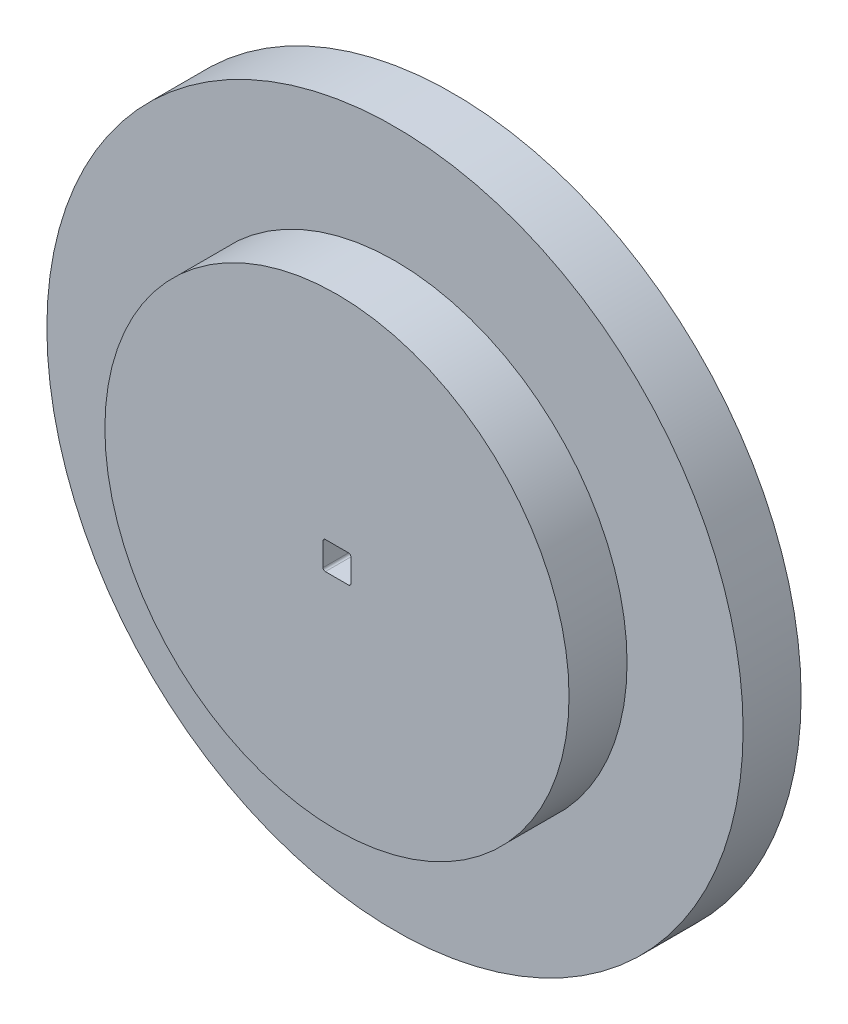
ISO-10303-21;
HEADER;
FILE_DESCRIPTION(('STEP AP214'),'2;1');
FILE_NAME('part.step','',(''),(''),'','','');
FILE_SCHEMA(('AUTOMOTIVE_DESIGN { 1 0 10303 214 1 1 1 1 }'));
ENDSEC;
DATA;
#1=APPLICATION_CONTEXT('core data for automotive mechanical design processes');
#2=APPLICATION_PROTOCOL_DEFINITION('international standard','automotive_design',2000,#1);
#3=PRODUCT_CONTEXT('',#1,'mechanical');
#4=PRODUCT('Part','Part','',(#3));
#5=PRODUCT_RELATED_PRODUCT_CATEGORY('part','',(#4));
#6=PRODUCT_DEFINITION_FORMATION('','',#4);
#7=PRODUCT_DEFINITION_CONTEXT('part definition',#1,'design');
#8=PRODUCT_DEFINITION('design','',#6,#7);
#9=PRODUCT_DEFINITION_SHAPE('','',#8);
#10=(LENGTH_UNIT() NAMED_UNIT(*) SI_UNIT(.MILLI.,.METRE.));
#11=(NAMED_UNIT(*) PLANE_ANGLE_UNIT() SI_UNIT($,.RADIAN.));
#12=(NAMED_UNIT(*) SI_UNIT($,.STERADIAN.) SOLID_ANGLE_UNIT());
#13=UNCERTAINTY_MEASURE_WITH_UNIT(LENGTH_MEASURE(1.E-05),#10,'distance_accuracy_value','');
#14=(GEOMETRIC_REPRESENTATION_CONTEXT(3) GLOBAL_UNCERTAINTY_ASSIGNED_CONTEXT((#13)) GLOBAL_UNIT_ASSIGNED_CONTEXT((#10,
#11,#12)) REPRESENTATION_CONTEXT('',''));
#15=CARTESIAN_POINT('',(0.,0.,0.));
#16=DIRECTION('',(0.,0.,1.));
#17=DIRECTION('',(1.,0.,0.));
#18=AXIS2_PLACEMENT_3D('',#15,#16,#17);
#19=CARTESIAN_POINT('',(0.,0.,6.35));
#20=DIRECTION('',(0.,0.,-1.));
#21=DIRECTION('',(-1.,0.,0.));
#22=AXIS2_PLACEMENT_3D('',#19,#20,#21);
#23=CYLINDRICAL_SURFACE('',#22,38.1);
#24=CARTESIAN_POINT('',(0.,0.,6.35));
#25=DIRECTION('',(0.,0.,1.));
#26=DIRECTION('',(1.,0.,0.));
#27=AXIS2_PLACEMENT_3D('',#24,#25,#26);
#28=CIRCLE('',#27,38.1);
#29=CARTESIAN_POINT('',(38.1,0.,6.35));
#30=VERTEX_POINT('',#29);
#31=EDGE_CURVE('E142',#30,#30,#28,.T.);
#32=ORIENTED_EDGE('',*,*,#31,.F.);
#33=EDGE_LOOP('',(#32));
#34=FACE_BOUND('',#33,.T.);
#35=CARTESIAN_POINT('',(0.,0.,0.));
#36=DIRECTION('',(0.,0.,1.));
#37=DIRECTION('',(1.,0.,0.));
#38=AXIS2_PLACEMENT_3D('',#35,#36,#37);
#39=CIRCLE('',#38,38.1);
#40=CARTESIAN_POINT('',(38.1,0.,0.));
#41=VERTEX_POINT('',#40);
#42=EDGE_CURVE('E137',#41,#41,#39,.T.);
#43=ORIENTED_EDGE('',*,*,#42,.T.);
#44=EDGE_LOOP('',(#43));
#45=FACE_BOUND('',#44,.T.);
#46=ADVANCED_FACE('F33',(#34,#45),#23,.T.);
#47=CARTESIAN_POINT('',(0.,0.,6.35));
#48=DIRECTION('',(0.,0.,1.));
#49=DIRECTION('',(1.,0.,0.));
#50=AXIS2_PLACEMENT_3D('',#47,#48,#49);
#51=PLANE('',#50);
#52=CARTESIAN_POINT('',(0.,0.,6.35));
#53=DIRECTION('',(0.,0.,1.));
#54=DIRECTION('',(1.,0.,0.));
#55=AXIS2_PLACEMENT_3D('',#52,#53,#54);
#56=CIRCLE('',#55,25.4);
#57=CARTESIAN_POINT('',(25.4,0.,6.35));
#58=VERTEX_POINT('',#57);
#59=EDGE_CURVE('E138',#58,#58,#56,.T.);
#60=ORIENTED_EDGE('',*,*,#59,.F.);
#61=EDGE_LOOP('',(#60));
#62=FACE_BOUND('',#61,.T.);
#63=ORIENTED_EDGE('',*,*,#31,.T.);
#64=EDGE_LOOP('',(#63));
#65=FACE_BOUND('',#64,.T.);
#66=ADVANCED_FACE('F203',(#62,#65),#51,.T.);
#67=CARTESIAN_POINT('',(0.,0.,0.));
#68=DIRECTION('',(0.,0.,1.));
#69=DIRECTION('',(1.,0.,0.));
#70=AXIS2_PLACEMENT_3D('',#67,#68,#69);
#71=PLANE('',#70);
#72=DIRECTION('',(1.,0.,0.));
#73=VECTOR('',#72,1.);
#74=CARTESIAN_POINT('',(1.524,1.524,0.));
#75=LINE('',#74,#73);
#76=CARTESIAN_POINT('',(-1.27,1.524,0.));
#77=VERTEX_POINT('',#76);
#78=CARTESIAN_POINT('',(1.27,1.524,0.));
#79=VERTEX_POINT('',#78);
#80=EDGE_CURVE('E114',#77,#79,#75,.T.);
#81=ORIENTED_EDGE('',*,*,#80,.F.);
#82=CARTESIAN_POINT('',(-1.27,1.27,0.));
#83=DIRECTION('',(0.,0.,1.));
#84=DIRECTION('',(1.,0.,0.));
#85=AXIS2_PLACEMENT_3D('',#82,#83,#84);
#86=CIRCLE('',#85,0.254);
#87=CARTESIAN_POINT('',(-1.524,1.27,0.));
#88=VERTEX_POINT('',#87);
#89=EDGE_CURVE('E98',#77,#88,#86,.T.);
#90=ORIENTED_EDGE('',*,*,#89,.T.);
#91=DIRECTION('',(0.,1.,0.));
#92=VECTOR('',#91,1.);
#93=CARTESIAN_POINT('',(-1.524,1.524,0.));
#94=LINE('',#93,#92);
#95=CARTESIAN_POINT('',(-1.524,-1.27,0.));
#96=VERTEX_POINT('',#95);
#97=EDGE_CURVE('E124',#96,#88,#94,.T.);
#98=ORIENTED_EDGE('',*,*,#97,.F.);
#99=CARTESIAN_POINT('',(-1.27,-1.27,0.));
#100=DIRECTION('',(0.,0.,1.));
#101=DIRECTION('',(1.,0.,0.));
#102=AXIS2_PLACEMENT_3D('',#99,#100,#101);
#103=CIRCLE('',#102,0.254);
#104=CARTESIAN_POINT('',(-1.27,-1.524,0.));
#105=VERTEX_POINT('',#104);
#106=EDGE_CURVE('E161',#96,#105,#103,.T.);
#107=ORIENTED_EDGE('',*,*,#106,.T.);
#108=DIRECTION('',(-1.,0.,0.));
#109=VECTOR('',#108,1.);
#110=CARTESIAN_POINT('',(1.524,-1.524,0.));
#111=LINE('',#110,#109);
#112=CARTESIAN_POINT('',(1.27,-1.524,0.));
#113=VERTEX_POINT('',#112);
#114=EDGE_CURVE('E126',#113,#105,#111,.T.);
#115=ORIENTED_EDGE('',*,*,#114,.F.);
#116=CARTESIAN_POINT('',(1.27,-1.27,0.));
#117=DIRECTION('',(0.,0.,1.));
#118=DIRECTION('',(1.,0.,0.));
#119=AXIS2_PLACEMENT_3D('',#116,#117,#118);
#120=CIRCLE('',#119,0.254);
#121=CARTESIAN_POINT('',(1.524,-1.27,0.));
#122=VERTEX_POINT('',#121);
#123=EDGE_CURVE('E165',#113,#122,#120,.T.);
#124=ORIENTED_EDGE('',*,*,#123,.T.);
#125=DIRECTION('',(0.,-1.,0.));
#126=VECTOR('',#125,1.);
#127=CARTESIAN_POINT('',(1.524,1.524,0.));
#128=LINE('',#127,#126);
#129=CARTESIAN_POINT('',(1.524,1.27,0.));
#130=VERTEX_POINT('',#129);
#131=EDGE_CURVE('E123',#130,#122,#128,.T.);
#132=ORIENTED_EDGE('',*,*,#131,.F.);
#133=CARTESIAN_POINT('',(1.27,1.27,0.));
#134=DIRECTION('',(0.,0.,1.));
#135=DIRECTION('',(1.,0.,0.));
#136=AXIS2_PLACEMENT_3D('',#133,#134,#135);
#137=CIRCLE('',#136,0.254);
#138=EDGE_CURVE('E41',#130,#79,#137,.T.);
#139=ORIENTED_EDGE('',*,*,#138,.T.);
#140=EDGE_LOOP('',(#81,#90,#98,#107,#115,#124,#132,#139));
#141=FACE_BOUND('',#140,.T.);
#142=ORIENTED_EDGE('',*,*,#42,.F.);
#143=EDGE_LOOP('',(#142));
#144=FACE_BOUND('',#143,.T.);
#145=ADVANCED_FACE('F120',(#141,#144),#71,.F.);
#146=CARTESIAN_POINT('',(0.,0.,12.7));
#147=DIRECTION('',(0.,0.,-1.));
#148=DIRECTION('',(-1.,0.,0.));
#149=AXIS2_PLACEMENT_3D('',#146,#147,#148);
#150=CYLINDRICAL_SURFACE('',#149,25.4);
#151=CARTESIAN_POINT('',(0.,0.,12.7));
#152=DIRECTION('',(0.,0.,1.));
#153=DIRECTION('',(1.,0.,0.));
#154=AXIS2_PLACEMENT_3D('',#151,#152,#153);
#155=CIRCLE('',#154,25.4);
#156=CARTESIAN_POINT('',(25.4,0.,12.7));
#157=VERTEX_POINT('',#156);
#158=EDGE_CURVE('E134',#157,#157,#155,.T.);
#159=ORIENTED_EDGE('',*,*,#158,.F.);
#160=EDGE_LOOP('',(#159));
#161=FACE_BOUND('',#160,.T.);
#162=ORIENTED_EDGE('',*,*,#59,.T.);
#163=EDGE_LOOP('',(#162));
#164=FACE_BOUND('',#163,.T.);
#165=ADVANCED_FACE('F215',(#161,#164),#150,.T.);
#166=CARTESIAN_POINT('',(0.,0.,12.7));
#167=DIRECTION('',(0.,0.,1.));
#168=DIRECTION('',(1.,0.,0.));
#169=AXIS2_PLACEMENT_3D('',#166,#167,#168);
#170=PLANE('',#169);
#171=DIRECTION('',(-1.,0.,0.));
#172=VECTOR('',#171,1.);
#173=CARTESIAN_POINT('',(1.524,-1.524,12.7));
#174=LINE('',#173,#172);
#175=CARTESIAN_POINT('',(1.27,-1.524,12.7));
#176=VERTEX_POINT('',#175);
#177=CARTESIAN_POINT('',(-1.27,-1.524,12.7));
#178=VERTEX_POINT('',#177);
#179=EDGE_CURVE('E141',#176,#178,#174,.T.);
#180=ORIENTED_EDGE('',*,*,#179,.T.);
#181=CARTESIAN_POINT('',(-1.27,-1.27,12.7));
#182=DIRECTION('',(0.,0.,1.));
#183=DIRECTION('',(1.,0.,0.));
#184=AXIS2_PLACEMENT_3D('',#181,#182,#183);
#185=CIRCLE('',#184,0.254);
#186=CARTESIAN_POINT('',(-1.524,-1.27,12.7));
#187=VERTEX_POINT('',#186);
#188=EDGE_CURVE('E163',#178,#187,#185,.F.);
#189=ORIENTED_EDGE('',*,*,#188,.T.);
#190=DIRECTION('',(0.,1.,0.));
#191=VECTOR('',#190,1.);
#192=CARTESIAN_POINT('',(-1.524,1.524,12.7));
#193=LINE('',#192,#191);
#194=CARTESIAN_POINT('',(-1.524,1.27,12.7));
#195=VERTEX_POINT('',#194);
#196=EDGE_CURVE('E133',#187,#195,#193,.T.);
#197=ORIENTED_EDGE('',*,*,#196,.T.);
#198=CARTESIAN_POINT('',(-1.27,1.27,12.7));
#199=DIRECTION('',(0.,0.,1.));
#200=DIRECTION('',(1.,0.,0.));
#201=AXIS2_PLACEMENT_3D('',#198,#199,#200);
#202=CIRCLE('',#201,0.254);
#203=CARTESIAN_POINT('',(-1.27,1.524,12.7));
#204=VERTEX_POINT('',#203);
#205=EDGE_CURVE('E108',#195,#204,#202,.F.);
#206=ORIENTED_EDGE('',*,*,#205,.T.);
#207=DIRECTION('',(1.,0.,0.));
#208=VECTOR('',#207,1.);
#209=CARTESIAN_POINT('',(1.524,1.524,12.7));
#210=LINE('',#209,#208);
#211=CARTESIAN_POINT('',(1.27,1.524,12.7));
#212=VERTEX_POINT('',#211);
#213=EDGE_CURVE('E116',#204,#212,#210,.T.);
#214=ORIENTED_EDGE('',*,*,#213,.T.);
#215=CARTESIAN_POINT('',(1.27,1.27,12.7));
#216=DIRECTION('',(0.,0.,1.));
#217=DIRECTION('',(1.,0.,0.));
#218=AXIS2_PLACEMENT_3D('',#215,#216,#217);
#219=CIRCLE('',#218,0.254);
#220=CARTESIAN_POINT('',(1.524,1.27,12.7));
#221=VERTEX_POINT('',#220);
#222=EDGE_CURVE('E11',#212,#221,#219,.F.);
#223=ORIENTED_EDGE('',*,*,#222,.T.);
#224=DIRECTION('',(0.,-1.,0.));
#225=VECTOR('',#224,1.);
#226=CARTESIAN_POINT('',(1.524,1.524,12.7));
#227=LINE('',#226,#225);
#228=CARTESIAN_POINT('',(1.524,-1.27,12.7));
#229=VERTEX_POINT('',#228);
#230=EDGE_CURVE('E174',#221,#229,#227,.T.);
#231=ORIENTED_EDGE('',*,*,#230,.T.);
#232=CARTESIAN_POINT('',(1.27,-1.27,12.7));
#233=DIRECTION('',(0.,0.,1.));
#234=DIRECTION('',(1.,0.,0.));
#235=AXIS2_PLACEMENT_3D('',#232,#233,#234);
#236=CIRCLE('',#235,0.254);
#237=EDGE_CURVE('E167',#229,#176,#236,.F.);
#238=ORIENTED_EDGE('',*,*,#237,.T.);
#239=EDGE_LOOP('',(#180,#189,#197,#206,#214,#223,#231,#238));
#240=FACE_BOUND('',#239,.T.);
#241=ORIENTED_EDGE('',*,*,#158,.T.);
#242=EDGE_LOOP('',(#241));
#243=FACE_BOUND('',#242,.T.);
#244=ADVANCED_FACE('F171',(#240,#243),#170,.T.);
#245=CARTESIAN_POINT('',(-1.524,1.524,12.7));
#246=DIRECTION('',(-1.,0.,0.));
#247=DIRECTION('',(0.,-1.,0.));
#248=AXIS2_PLACEMENT_3D('',#245,#246,#247);
#249=PLANE('',#248);
#250=ORIENTED_EDGE('',*,*,#97,.T.);
#251=DIRECTION('',(0.,0.,-1.));
#252=VECTOR('',#251,1.);
#253=CARTESIAN_POINT('',(-1.524,1.27,12.7));
#254=LINE('',#253,#252);
#255=EDGE_CURVE('E103',#88,#195,#254,.F.);
#256=ORIENTED_EDGE('',*,*,#255,.T.);
#257=ORIENTED_EDGE('',*,*,#196,.F.);
#258=DIRECTION('',(0.,0.,-1.));
#259=VECTOR('',#258,1.);
#260=CARTESIAN_POINT('',(-1.524,-1.27,0.));
#261=LINE('',#260,#259);
#262=EDGE_CURVE('E117',#187,#96,#261,.T.);
#263=ORIENTED_EDGE('',*,*,#262,.T.);
#264=EDGE_LOOP('',(#250,#256,#257,#263));
#265=FACE_BOUND('',#264,.T.);
#266=ADVANCED_FACE('F192',(#265),#249,.F.);
#267=CARTESIAN_POINT('',(1.524,-1.524,12.7));
#268=DIRECTION('',(0.,-1.,0.));
#269=DIRECTION('',(0.,0.,-1.));
#270=AXIS2_PLACEMENT_3D('',#267,#268,#269);
#271=PLANE('',#270);
#272=ORIENTED_EDGE('',*,*,#114,.T.);
#273=DIRECTION('',(0.,0.,-1.));
#274=VECTOR('',#273,1.);
#275=CARTESIAN_POINT('',(-1.27,-1.524,12.7));
#276=LINE('',#275,#274);
#277=EDGE_CURVE('E154',#105,#178,#276,.F.);
#278=ORIENTED_EDGE('',*,*,#277,.T.);
#279=ORIENTED_EDGE('',*,*,#179,.F.);
#280=DIRECTION('',(0.,0.,-1.));
#281=VECTOR('',#280,1.);
#282=CARTESIAN_POINT('',(1.27,-1.524,0.));
#283=LINE('',#282,#281);
#284=EDGE_CURVE('E151',#176,#113,#283,.T.);
#285=ORIENTED_EDGE('',*,*,#284,.T.);
#286=EDGE_LOOP('',(#272,#278,#279,#285));
#287=FACE_BOUND('',#286,.T.);
#288=ADVANCED_FACE('F178',(#287),#271,.F.);
#289=CARTESIAN_POINT('',(1.524,1.524,12.7));
#290=DIRECTION('',(1.,0.,0.));
#291=DIRECTION('',(0.,1.,0.));
#292=AXIS2_PLACEMENT_3D('',#289,#290,#291);
#293=PLANE('',#292);
#294=ORIENTED_EDGE('',*,*,#131,.T.);
#295=DIRECTION('',(0.,0.,-1.));
#296=VECTOR('',#295,1.);
#297=CARTESIAN_POINT('',(1.524,-1.27,12.7));
#298=LINE('',#297,#296);
#299=EDGE_CURVE('E48',#122,#229,#298,.F.);
#300=ORIENTED_EDGE('',*,*,#299,.T.);
#301=ORIENTED_EDGE('',*,*,#230,.F.);
#302=DIRECTION('',(0.,0.,-1.));
#303=VECTOR('',#302,1.);
#304=CARTESIAN_POINT('',(1.524,1.27,0.));
#305=LINE('',#304,#303);
#306=EDGE_CURVE('E156',#221,#130,#305,.T.);
#307=ORIENTED_EDGE('',*,*,#306,.T.);
#308=EDGE_LOOP('',(#294,#300,#301,#307));
#309=FACE_BOUND('',#308,.T.);
#310=ADVANCED_FACE('F182',(#309),#293,.F.);
#311=CARTESIAN_POINT('',(1.524,1.524,12.7));
#312=DIRECTION('',(0.,1.,0.));
#313=DIRECTION('',(0.,0.,1.));
#314=AXIS2_PLACEMENT_3D('',#311,#312,#313);
#315=PLANE('',#314);
#316=ORIENTED_EDGE('',*,*,#213,.F.);
#317=DIRECTION('',(0.,0.,-1.));
#318=VECTOR('',#317,1.);
#319=CARTESIAN_POINT('',(-1.27,1.524,0.));
#320=LINE('',#319,#318);
#321=EDGE_CURVE('E102',#204,#77,#320,.T.);
#322=ORIENTED_EDGE('',*,*,#321,.T.);
#323=ORIENTED_EDGE('',*,*,#80,.T.);
#324=DIRECTION('',(0.,0.,-1.));
#325=VECTOR('',#324,1.);
#326=CARTESIAN_POINT('',(1.27,1.524,12.7));
#327=LINE('',#326,#325);
#328=EDGE_CURVE('E118',#79,#212,#327,.F.);
#329=ORIENTED_EDGE('',*,*,#328,.T.);
#330=EDGE_LOOP('',(#316,#322,#323,#329));
#331=FACE_BOUND('',#330,.T.);
#332=ADVANCED_FACE('F113',(#331),#315,.F.);
#333=CARTESIAN_POINT('',(-1.27,1.27,12.7));
#334=DIRECTION('',(0.,0.,1.));
#335=DIRECTION('',(1.,0.,0.));
#336=AXIS2_PLACEMENT_3D('',#333,#334,#335);
#337=CYLINDRICAL_SURFACE('',#336,0.254);
#338=ORIENTED_EDGE('',*,*,#205,.F.);
#339=ORIENTED_EDGE('',*,*,#255,.F.);
#340=ORIENTED_EDGE('',*,*,#89,.F.);
#341=ORIENTED_EDGE('',*,*,#321,.F.);
#342=EDGE_LOOP('',(#338,#339,#340,#341));
#343=FACE_BOUND('',#342,.T.);
#344=ADVANCED_FACE('F101',(#343),#337,.F.);
#345=CARTESIAN_POINT('',(-1.27,-1.27,12.7));
#346=DIRECTION('',(0.,0.,1.));
#347=DIRECTION('',(1.,0.,0.));
#348=AXIS2_PLACEMENT_3D('',#345,#346,#347);
#349=CYLINDRICAL_SURFACE('',#348,0.254);
#350=ORIENTED_EDGE('',*,*,#188,.F.);
#351=ORIENTED_EDGE('',*,*,#277,.F.);
#352=ORIENTED_EDGE('',*,*,#106,.F.);
#353=ORIENTED_EDGE('',*,*,#262,.F.);
#354=EDGE_LOOP('',(#350,#351,#352,#353));
#355=FACE_BOUND('',#354,.T.);
#356=ADVANCED_FACE('F194',(#355),#349,.F.);
#357=CARTESIAN_POINT('',(1.27,-1.27,12.7));
#358=DIRECTION('',(0.,0.,1.));
#359=DIRECTION('',(1.,0.,0.));
#360=AXIS2_PLACEMENT_3D('',#357,#358,#359);
#361=CYLINDRICAL_SURFACE('',#360,0.254);
#362=ORIENTED_EDGE('',*,*,#237,.F.);
#363=ORIENTED_EDGE('',*,*,#299,.F.);
#364=ORIENTED_EDGE('',*,*,#123,.F.);
#365=ORIENTED_EDGE('',*,*,#284,.F.);
#366=EDGE_LOOP('',(#362,#363,#364,#365));
#367=FACE_BOUND('',#366,.T.);
#368=ADVANCED_FACE('F181',(#367),#361,.F.);
#369=CARTESIAN_POINT('',(1.27,1.27,12.7));
#370=DIRECTION('',(0.,0.,1.));
#371=DIRECTION('',(1.,0.,0.));
#372=AXIS2_PLACEMENT_3D('',#369,#370,#371);
#373=CYLINDRICAL_SURFACE('',#372,0.254);
#374=ORIENTED_EDGE('',*,*,#222,.F.);
#375=ORIENTED_EDGE('',*,*,#328,.F.);
#376=ORIENTED_EDGE('',*,*,#138,.F.);
#377=ORIENTED_EDGE('',*,*,#306,.F.);
#378=EDGE_LOOP('',(#374,#375,#376,#377));
#379=FACE_BOUND('',#378,.T.);
#380=ADVANCED_FACE('F35',(#379),#373,.F.);
#381=CLOSED_SHELL('',(#46,#66,#145,#165,#244,#266,#288,#310,#332,#344,#356,#368,#380));
#382=MANIFOLD_SOLID_BREP('B2',#381);
#383=ADVANCED_BREP_SHAPE_REPRESENTATION('',(#18,#382),#14);
#384=SHAPE_DEFINITION_REPRESENTATION(#9,#383);
ENDSEC;
END-ISO-10303-21;
